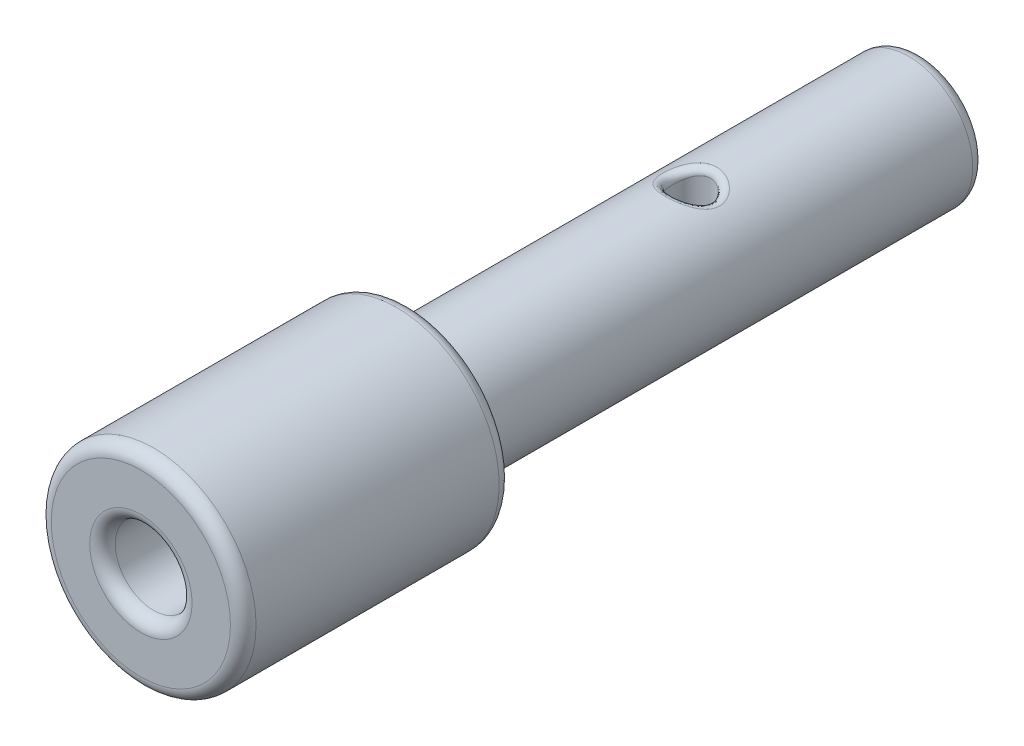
from build123d import *

# Parameters (mm, degrees)
FILLET_1_R          = 0.5
SKETCH_2_R          = 0.75
CUT_EXTRUDE_1_DEPTH = 5
FILLET_2_R          = 0.25


with BuildPart() as part:
    # Sketch 1 → Revolve 1 (revolve)
    with BuildSketch(Plane(origin=(0, 0, 0), x_dir=(0, 0, -1), z_dir=(1, 0, 0)), mode=Mode.PRIVATE) as revolve_1_sk:
        Polygon((0, 1.5), (12, 1.5), (12, 0), (30.5, 0), (30.5, 2.5), (10.5, 2.5), (10.5, 4), (0, 4), align=None)
    revolve(revolve_1_sk.sketch.rotate(Axis((0, 0, 0), (0, 0, -1)), 90), axis=Axis((0, 0, 0), (0, 0, -1)))

    # Fillet 1
    fillet_1_edges = [part.edges().sort_by_distance(p)[0] for p in [
        (-4, 0, 0),
        (-4, 0, -10.5),
        (-2.5, 0, -10.5),
        (-2.5, 0, -30.5),
        (-1.5, 0, -12),
        (-1.5, 0, 0),
    ]]
    fillet(fillet_1_edges, radius=FILLET_1_R)

    # Sketch 2 → Cut-Extrude 1 (cut, symmetric)
    with BuildSketch(Plane(origin=(0, 0, 0), x_dir=(1, 0, 0), z_dir=(0, 1, 0))):
        with Locations(Location((0, 21.5, 0), (0, 0, 270))):
            Circle(SKETCH_2_R)
    extrude(amount=CUT_EXTRUDE_1_DEPTH, both=True, mode=Mode.SUBTRACT)

    # Fillet 2
    fillet_2_edges = [part.edges().sort_by_distance(p)[0] for p in [
        (0, 2.5, -22.25),
        (0, -2.5, -22.25),
    ]]
    fillet(fillet_2_edges, radius=FILLET_2_R)


solid = part.part
